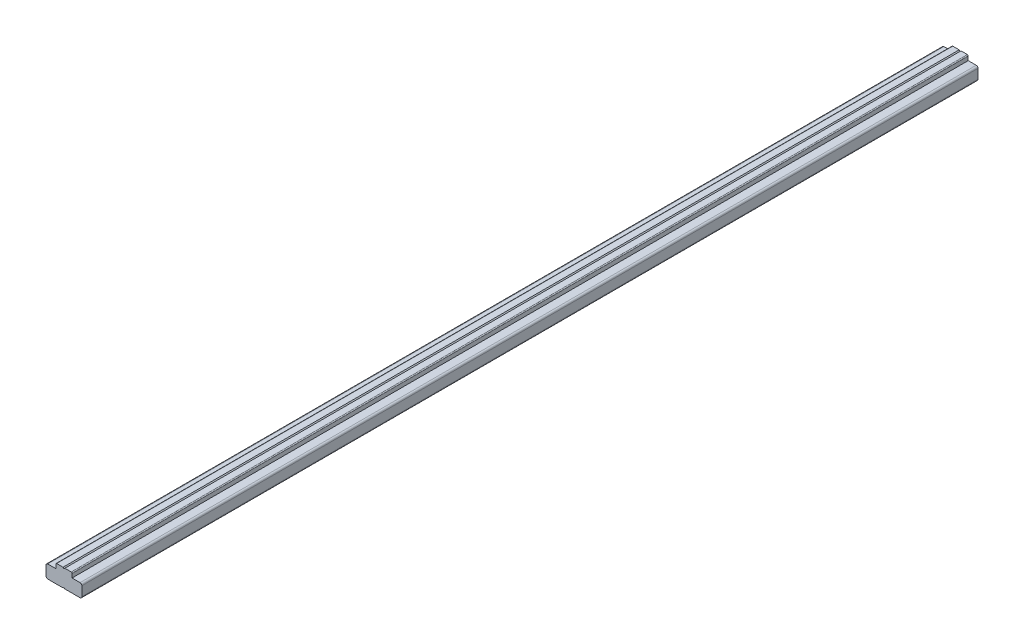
ISO-10303-21;
HEADER;
FILE_DESCRIPTION(('STEP AP214'),'2;1');
FILE_NAME('part.step','',(''),(''),'','','');
FILE_SCHEMA(('AUTOMOTIVE_DESIGN { 1 0 10303 214 1 1 1 1 }'));
ENDSEC;
DATA;
#1=APPLICATION_CONTEXT('core data for automotive mechanical design processes');
#2=APPLICATION_PROTOCOL_DEFINITION('international standard','automotive_design',2000,#1);
#3=PRODUCT_CONTEXT('',#1,'mechanical');
#4=PRODUCT('Part','Part','',(#3));
#5=PRODUCT_RELATED_PRODUCT_CATEGORY('part','',(#4));
#6=PRODUCT_DEFINITION_FORMATION('','',#4);
#7=PRODUCT_DEFINITION_CONTEXT('part definition',#1,'design');
#8=PRODUCT_DEFINITION('design','',#6,#7);
#9=PRODUCT_DEFINITION_SHAPE('','',#8);
#10=(LENGTH_UNIT() NAMED_UNIT(*) SI_UNIT(.MILLI.,.METRE.));
#11=(NAMED_UNIT(*) PLANE_ANGLE_UNIT() SI_UNIT($,.RADIAN.));
#12=(NAMED_UNIT(*) SI_UNIT($,.STERADIAN.) SOLID_ANGLE_UNIT());
#13=UNCERTAINTY_MEASURE_WITH_UNIT(LENGTH_MEASURE(1.E-05),#10,'distance_accuracy_value','');
#14=(GEOMETRIC_REPRESENTATION_CONTEXT(3) GLOBAL_UNCERTAINTY_ASSIGNED_CONTEXT((#13)) GLOBAL_UNIT_ASSIGNED_CONTEXT((#10,
#11,#12)) REPRESENTATION_CONTEXT('',''));
#15=CARTESIAN_POINT('',(0.,0.,0.));
#16=DIRECTION('',(0.,0.,1.));
#17=DIRECTION('',(1.,0.,0.));
#18=AXIS2_PLACEMENT_3D('',#15,#16,#17);
#19=CARTESIAN_POINT('',(0.,0.5,0.));
#20=DIRECTION('',(-0.707106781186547,-0.707106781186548,0.));
#21=DIRECTION('',(0.707106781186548,-0.707106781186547,0.));
#22=AXIS2_PLACEMENT_3D('',#19,#20,#21);
#23=PLANE('',#22);
#24=DIRECTION('',(0.707106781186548,-0.707106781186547,0.));
#25=VECTOR('',#24,1.);
#26=CARTESIAN_POINT('',(0.,0.5,500.));
#27=LINE('',#26,#25);
#28=CARTESIAN_POINT('',(0.,0.5,500.));
#29=VERTEX_POINT('',#28);
#30=CARTESIAN_POINT('',(0.5,0.,500.));
#31=VERTEX_POINT('',#30);
#32=EDGE_CURVE('E212',#29,#31,#27,.T.);
#33=ORIENTED_EDGE('',*,*,#32,.F.);
#34=DIRECTION('',(0.,0.,1.));
#35=VECTOR('',#34,1.);
#36=CARTESIAN_POINT('',(0.,0.5,0.));
#37=LINE('',#36,#35);
#38=CARTESIAN_POINT('',(0.,0.5,0.));
#39=VERTEX_POINT('',#38);
#40=EDGE_CURVE('E177',#39,#29,#37,.T.);
#41=ORIENTED_EDGE('',*,*,#40,.F.);
#42=DIRECTION('',(0.707106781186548,-0.707106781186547,0.));
#43=VECTOR('',#42,1.);
#44=CARTESIAN_POINT('',(0.,0.5,0.));
#45=LINE('',#44,#43);
#46=CARTESIAN_POINT('',(0.5,0.,0.));
#47=VERTEX_POINT('',#46);
#48=EDGE_CURVE('E170',#39,#47,#45,.T.);
#49=ORIENTED_EDGE('',*,*,#48,.T.);
#50=DIRECTION('',(0.,0.,1.));
#51=VECTOR('',#50,1.);
#52=CARTESIAN_POINT('',(0.5,0.,0.));
#53=LINE('',#52,#51);
#54=EDGE_CURVE('E151',#47,#31,#53,.T.);
#55=ORIENTED_EDGE('',*,*,#54,.T.);
#56=EDGE_LOOP('',(#33,#41,#49,#55));
#57=FACE_BOUND('',#56,.T.);
#58=ADVANCED_FACE('F14',(#57),#23,.T.);
#59=CARTESIAN_POINT('',(0.,0.5,0.));
#60=DIRECTION('',(0.707106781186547,-0.707106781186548,0.));
#61=DIRECTION('',(0.707106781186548,0.707106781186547,0.));
#62=AXIS2_PLACEMENT_3D('',#59,#60,#61);
#63=PLANE('',#62);
#64=DIRECTION('',(0.707106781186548,0.707106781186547,0.));
#65=VECTOR('',#64,1.);
#66=CARTESIAN_POINT('',(0.,0.5,500.));
#67=LINE('',#66,#65);
#68=CARTESIAN_POINT('',(-0.5,0.,500.));
#69=VERTEX_POINT('',#68);
#70=EDGE_CURVE('E178',#69,#29,#67,.T.);
#71=ORIENTED_EDGE('',*,*,#70,.F.);
#72=DIRECTION('',(0.,0.,1.));
#73=VECTOR('',#72,1.);
#74=CARTESIAN_POINT('',(-0.5,0.,0.));
#75=LINE('',#74,#73);
#76=CARTESIAN_POINT('',(-0.5,0.,0.));
#77=VERTEX_POINT('',#76);
#78=EDGE_CURVE('E245',#77,#69,#75,.T.);
#79=ORIENTED_EDGE('',*,*,#78,.F.);
#80=DIRECTION('',(0.707106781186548,0.707106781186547,0.));
#81=VECTOR('',#80,1.);
#82=CARTESIAN_POINT('',(0.,0.5,0.));
#83=LINE('',#82,#81);
#84=EDGE_CURVE('E164',#77,#39,#83,.T.);
#85=ORIENTED_EDGE('',*,*,#84,.T.);
#86=ORIENTED_EDGE('',*,*,#40,.T.);
#87=EDGE_LOOP('',(#71,#79,#85,#86));
#88=FACE_BOUND('',#87,.T.);
#89=ADVANCED_FACE('F363',(#88),#63,.T.);
#90=CARTESIAN_POINT('',(-10.,0.,0.));
#91=DIRECTION('',(0.,-1.,0.));
#92=DIRECTION('',(0.,0.,-1.));
#93=AXIS2_PLACEMENT_3D('',#90,#91,#92);
#94=PLANE('',#93);
#95=DIRECTION('',(1.,0.,0.));
#96=VECTOR('',#95,1.);
#97=CARTESIAN_POINT('',(-10.,0.,500.));
#98=LINE('',#97,#96);
#99=CARTESIAN_POINT('',(-9.,0.,500.));
#100=VERTEX_POINT('',#99);
#101=EDGE_CURVE('E181',#100,#69,#98,.T.);
#102=ORIENTED_EDGE('',*,*,#101,.F.);
#103=DIRECTION('',(0.,0.,1.));
#104=VECTOR('',#103,1.);
#105=CARTESIAN_POINT('',(-9.,0.,0.));
#106=LINE('',#105,#104);
#107=CARTESIAN_POINT('',(-9.,0.,0.));
#108=VERTEX_POINT('',#107);
#109=EDGE_CURVE('E291',#100,#108,#106,.F.);
#110=ORIENTED_EDGE('',*,*,#109,.T.);
#111=DIRECTION('',(1.,0.,0.));
#112=VECTOR('',#111,1.);
#113=CARTESIAN_POINT('',(-10.,0.,0.));
#114=LINE('',#113,#112);
#115=EDGE_CURVE('E209',#108,#77,#114,.T.);
#116=ORIENTED_EDGE('',*,*,#115,.T.);
#117=ORIENTED_EDGE('',*,*,#78,.T.);
#118=EDGE_LOOP('',(#102,#110,#116,#117));
#119=FACE_BOUND('',#118,.T.);
#120=ADVANCED_FACE('F369',(#119),#94,.T.);
#121=CARTESIAN_POINT('',(-10.,7.3,0.));
#122=DIRECTION('',(-1.,0.,0.));
#123=DIRECTION('',(0.,-1.,0.));
#124=AXIS2_PLACEMENT_3D('',#121,#122,#123);
#125=PLANE('',#124);
#126=DIRECTION('',(0.,-1.,0.));
#127=VECTOR('',#126,1.);
#128=CARTESIAN_POINT('',(-10.,7.3,500.));
#129=LINE('',#128,#127);
#130=CARTESIAN_POINT('',(-10.,6.3,500.));
#131=VERTEX_POINT('',#130);
#132=CARTESIAN_POINT('',(-10.,1.,500.));
#133=VERTEX_POINT('',#132);
#134=EDGE_CURVE('E239',#131,#133,#129,.T.);
#135=ORIENTED_EDGE('',*,*,#134,.F.);
#136=DIRECTION('',(0.,0.,1.));
#137=VECTOR('',#136,1.);
#138=CARTESIAN_POINT('',(-10.,6.3,0.));
#139=LINE('',#138,#137);
#140=CARTESIAN_POINT('',(-10.,6.3,0.));
#141=VERTEX_POINT('',#140);
#142=EDGE_CURVE('E289',#131,#141,#139,.F.);
#143=ORIENTED_EDGE('',*,*,#142,.T.);
#144=DIRECTION('',(0.,-1.,0.));
#145=VECTOR('',#144,1.);
#146=CARTESIAN_POINT('',(-10.,7.3,0.));
#147=LINE('',#146,#145);
#148=CARTESIAN_POINT('',(-10.,1.,0.));
#149=VERTEX_POINT('',#148);
#150=EDGE_CURVE('E206',#141,#149,#147,.T.);
#151=ORIENTED_EDGE('',*,*,#150,.T.);
#152=DIRECTION('',(0.,0.,1.));
#153=VECTOR('',#152,1.);
#154=CARTESIAN_POINT('',(-10.,1.,0.));
#155=LINE('',#154,#153);
#156=EDGE_CURVE('E286',#149,#133,#155,.T.);
#157=ORIENTED_EDGE('',*,*,#156,.T.);
#158=EDGE_LOOP('',(#135,#143,#151,#157));
#159=FACE_BOUND('',#158,.T.);
#160=ADVANCED_FACE('F395',(#159),#125,.T.);
#161=CARTESIAN_POINT('',(-4.55,7.3,0.));
#162=DIRECTION('',(0.,1.,0.));
#163=DIRECTION('',(-1.,0.,0.));
#164=AXIS2_PLACEMENT_3D('',#161,#162,#163);
#165=PLANE('',#164);
#166=DIRECTION('',(-1.,0.,0.));
#167=VECTOR('',#166,1.);
#168=CARTESIAN_POINT('',(-4.55,7.3,0.));
#169=LINE('',#168,#167);
#170=CARTESIAN_POINT('',(-4.55,7.3,0.));
#171=VERTEX_POINT('',#170);
#172=CARTESIAN_POINT('',(-9.,7.3,0.));
#173=VERTEX_POINT('',#172);
#174=EDGE_CURVE('E203',#171,#173,#169,.T.);
#175=ORIENTED_EDGE('',*,*,#174,.T.);
#176=DIRECTION('',(0.,0.,1.));
#177=VECTOR('',#176,1.);
#178=CARTESIAN_POINT('',(-9.,7.3,0.));
#179=LINE('',#178,#177);
#180=CARTESIAN_POINT('',(-9.,7.3,500.));
#181=VERTEX_POINT('',#180);
#182=EDGE_CURVE('E283',#173,#181,#179,.T.);
#183=ORIENTED_EDGE('',*,*,#182,.T.);
#184=DIRECTION('',(-1.,0.,0.));
#185=VECTOR('',#184,1.);
#186=CARTESIAN_POINT('',(-4.55,7.3,500.));
#187=LINE('',#186,#185);
#188=CARTESIAN_POINT('',(-4.55,7.3,500.));
#189=VERTEX_POINT('',#188);
#190=EDGE_CURVE('E236',#189,#181,#187,.T.);
#191=ORIENTED_EDGE('',*,*,#190,.F.);
#192=DIRECTION('',(0.,0.,1.));
#193=VECTOR('',#192,1.);
#194=CARTESIAN_POINT('',(-4.55,7.3,0.));
#195=LINE('',#194,#193);
#196=EDGE_CURVE('E248',#171,#189,#195,.T.);
#197=ORIENTED_EDGE('',*,*,#196,.F.);
#198=EDGE_LOOP('',(#175,#183,#191,#197));
#199=FACE_BOUND('',#198,.T.);
#200=ADVANCED_FACE('F392',(#199),#165,.T.);
#201=CARTESIAN_POINT('',(-4.55,10.,0.));
#202=DIRECTION('',(-1.,0.,0.));
#203=DIRECTION('',(0.,-1.,0.));
#204=AXIS2_PLACEMENT_3D('',#201,#202,#203);
#205=PLANE('',#204);
#206=DIRECTION('',(0.,-1.,0.));
#207=VECTOR('',#206,1.);
#208=CARTESIAN_POINT('',(-4.55,10.,500.));
#209=LINE('',#208,#207);
#210=CARTESIAN_POINT('',(-4.55,9.5,500.));
#211=VERTEX_POINT('',#210);
#212=EDGE_CURVE('E234',#211,#189,#209,.T.);
#213=ORIENTED_EDGE('',*,*,#212,.F.);
#214=DIRECTION('',(0.,0.,1.));
#215=VECTOR('',#214,1.);
#216=CARTESIAN_POINT('',(-4.55,9.5,0.));
#217=LINE('',#216,#215);
#218=CARTESIAN_POINT('',(-4.55,9.5,0.));
#219=VERTEX_POINT('',#218);
#220=EDGE_CURVE('E9',#211,#219,#217,.F.);
#221=ORIENTED_EDGE('',*,*,#220,.T.);
#222=DIRECTION('',(0.,-1.,0.));
#223=VECTOR('',#222,1.);
#224=CARTESIAN_POINT('',(-4.55,10.,0.));
#225=LINE('',#224,#223);
#226=EDGE_CURVE('E201',#219,#171,#225,.T.);
#227=ORIENTED_EDGE('',*,*,#226,.T.);
#228=ORIENTED_EDGE('',*,*,#196,.T.);
#229=EDGE_LOOP('',(#213,#221,#227,#228));
#230=FACE_BOUND('',#229,.T.);
#231=ADVANCED_FACE('F389',(#230),#205,.T.);
#232=CARTESIAN_POINT('',(-0.5,10.,0.));
#233=DIRECTION('',(0.,1.,0.));
#234=DIRECTION('',(-1.,0.,0.));
#235=AXIS2_PLACEMENT_3D('',#232,#233,#234);
#236=PLANE('',#235);
#237=DIRECTION('',(-1.,0.,0.));
#238=VECTOR('',#237,1.);
#239=CARTESIAN_POINT('',(-0.5,10.,0.));
#240=LINE('',#239,#238);
#241=CARTESIAN_POINT('',(-0.5,10.,0.));
#242=VERTEX_POINT('',#241);
#243=CARTESIAN_POINT('',(-4.05,10.,0.));
#244=VERTEX_POINT('',#243);
#245=EDGE_CURVE('E199',#242,#244,#240,.T.);
#246=ORIENTED_EDGE('',*,*,#245,.T.);
#247=DIRECTION('',(0.,0.,1.));
#248=VECTOR('',#247,1.);
#249=CARTESIAN_POINT('',(-4.05,10.,0.));
#250=LINE('',#249,#248);
#251=CARTESIAN_POINT('',(-4.05,10.,500.));
#252=VERTEX_POINT('',#251);
#253=EDGE_CURVE('E22',#244,#252,#250,.T.);
#254=ORIENTED_EDGE('',*,*,#253,.T.);
#255=DIRECTION('',(-1.,0.,0.));
#256=VECTOR('',#255,1.);
#257=CARTESIAN_POINT('',(-0.5,10.,500.));
#258=LINE('',#257,#256);
#259=CARTESIAN_POINT('',(-0.5,10.,500.));
#260=VERTEX_POINT('',#259);
#261=EDGE_CURVE('E231',#260,#252,#258,.T.);
#262=ORIENTED_EDGE('',*,*,#261,.F.);
#263=DIRECTION('',(0.,0.,1.));
#264=VECTOR('',#263,1.);
#265=CARTESIAN_POINT('',(-0.5,10.,0.));
#266=LINE('',#265,#264);
#267=EDGE_CURVE('E251',#242,#260,#266,.T.);
#268=ORIENTED_EDGE('',*,*,#267,.F.);
#269=EDGE_LOOP('',(#246,#254,#262,#268));
#270=FACE_BOUND('',#269,.T.);
#271=ADVANCED_FACE('F308',(#270),#236,.T.);
#272=CARTESIAN_POINT('',(-0.5,10.,0.));
#273=DIRECTION('',(0.707106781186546,0.707106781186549,0.));
#274=DIRECTION('',(-0.707106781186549,0.707106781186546,0.));
#275=AXIS2_PLACEMENT_3D('',#272,#273,#274);
#276=PLANE('',#275);
#277=DIRECTION('',(-0.707106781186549,0.707106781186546,0.));
#278=VECTOR('',#277,1.);
#279=CARTESIAN_POINT('',(-0.5,10.,500.));
#280=LINE('',#279,#278);
#281=CARTESIAN_POINT('',(0.,9.5,500.));
#282=VERTEX_POINT('',#281);
#283=EDGE_CURVE('E228',#282,#260,#280,.T.);
#284=ORIENTED_EDGE('',*,*,#283,.F.);
#285=DIRECTION('',(0.,0.,1.));
#286=VECTOR('',#285,1.);
#287=CARTESIAN_POINT('',(0.,9.5,0.));
#288=LINE('',#287,#286);
#289=CARTESIAN_POINT('',(0.,9.5,0.));
#290=VERTEX_POINT('',#289);
#291=EDGE_CURVE('E253',#290,#282,#288,.T.);
#292=ORIENTED_EDGE('',*,*,#291,.F.);
#293=DIRECTION('',(-0.707106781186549,0.707106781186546,0.));
#294=VECTOR('',#293,1.);
#295=CARTESIAN_POINT('',(-0.5,10.,0.));
#296=LINE('',#295,#294);
#297=EDGE_CURVE('E196',#290,#242,#296,.T.);
#298=ORIENTED_EDGE('',*,*,#297,.T.);
#299=ORIENTED_EDGE('',*,*,#267,.T.);
#300=EDGE_LOOP('',(#284,#292,#298,#299));
#301=FACE_BOUND('',#300,.T.);
#302=ADVANCED_FACE('F315',(#301),#276,.T.);
#303=CARTESIAN_POINT('',(0.5,10.,0.));
#304=DIRECTION('',(-0.707106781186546,0.707106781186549,0.));
#305=DIRECTION('',(-0.707106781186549,-0.707106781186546,0.));
#306=AXIS2_PLACEMENT_3D('',#303,#304,#305);
#307=PLANE('',#306);
#308=DIRECTION('',(-0.707106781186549,-0.707106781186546,0.));
#309=VECTOR('',#308,1.);
#310=CARTESIAN_POINT('',(0.5,10.,500.));
#311=LINE('',#310,#309);
#312=CARTESIAN_POINT('',(0.5,10.,500.));
#313=VERTEX_POINT('',#312);
#314=EDGE_CURVE('E225',#313,#282,#311,.T.);
#315=ORIENTED_EDGE('',*,*,#314,.F.);
#316=DIRECTION('',(0.,0.,1.));
#317=VECTOR('',#316,1.);
#318=CARTESIAN_POINT('',(0.5,10.,0.));
#319=LINE('',#318,#317);
#320=CARTESIAN_POINT('',(0.5,10.,0.));
#321=VERTEX_POINT('',#320);
#322=EDGE_CURVE('E255',#321,#313,#319,.T.);
#323=ORIENTED_EDGE('',*,*,#322,.F.);
#324=DIRECTION('',(-0.707106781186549,-0.707106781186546,0.));
#325=VECTOR('',#324,1.);
#326=CARTESIAN_POINT('',(0.5,10.,0.));
#327=LINE('',#326,#325);
#328=EDGE_CURVE('E193',#321,#290,#327,.T.);
#329=ORIENTED_EDGE('',*,*,#328,.T.);
#330=ORIENTED_EDGE('',*,*,#291,.T.);
#331=EDGE_LOOP('',(#315,#323,#329,#330));
#332=FACE_BOUND('',#331,.T.);
#333=ADVANCED_FACE('F320',(#332),#307,.T.);
#334=CARTESIAN_POINT('',(4.55,10.,0.));
#335=DIRECTION('',(0.,1.,0.));
#336=DIRECTION('',(-1.,0.,0.));
#337=AXIS2_PLACEMENT_3D('',#334,#335,#336);
#338=PLANE('',#337);
#339=DIRECTION('',(-1.,0.,0.));
#340=VECTOR('',#339,1.);
#341=CARTESIAN_POINT('',(4.55,10.,500.));
#342=LINE('',#341,#340);
#343=CARTESIAN_POINT('',(4.05,10.,500.));
#344=VERTEX_POINT('',#343);
#345=EDGE_CURVE('E223',#344,#313,#342,.T.);
#346=ORIENTED_EDGE('',*,*,#345,.F.);
#347=DIRECTION('',(0.,0.,1.));
#348=VECTOR('',#347,1.);
#349=CARTESIAN_POINT('',(4.05,10.,0.));
#350=LINE('',#349,#348);
#351=CARTESIAN_POINT('',(4.05,10.,0.));
#352=VERTEX_POINT('',#351);
#353=EDGE_CURVE('E300',#344,#352,#350,.F.);
#354=ORIENTED_EDGE('',*,*,#353,.T.);
#355=DIRECTION('',(-1.,0.,0.));
#356=VECTOR('',#355,1.);
#357=CARTESIAN_POINT('',(4.55,10.,0.));
#358=LINE('',#357,#356);
#359=EDGE_CURVE('E191',#352,#321,#358,.T.);
#360=ORIENTED_EDGE('',*,*,#359,.T.);
#361=ORIENTED_EDGE('',*,*,#322,.T.);
#362=EDGE_LOOP('',(#346,#354,#360,#361));
#363=FACE_BOUND('',#362,.T.);
#364=ADVANCED_FACE('F323',(#363),#338,.T.);
#365=CARTESIAN_POINT('',(4.55,7.3,0.));
#366=DIRECTION('',(1.,0.,0.));
#367=DIRECTION('',(0.,1.,0.));
#368=AXIS2_PLACEMENT_3D('',#365,#366,#367);
#369=PLANE('',#368);
#370=DIRECTION('',(0.,1.,0.));
#371=VECTOR('',#370,1.);
#372=CARTESIAN_POINT('',(4.55,7.3,0.));
#373=LINE('',#372,#371);
#374=CARTESIAN_POINT('',(4.55,7.3,0.));
#375=VERTEX_POINT('',#374);
#376=CARTESIAN_POINT('',(4.55,9.5,0.));
#377=VERTEX_POINT('',#376);
#378=EDGE_CURVE('E188',#375,#377,#373,.T.);
#379=ORIENTED_EDGE('',*,*,#378,.T.);
#380=DIRECTION('',(0.,0.,1.));
#381=VECTOR('',#380,1.);
#382=CARTESIAN_POINT('',(4.55,9.5,0.));
#383=LINE('',#382,#381);
#384=CARTESIAN_POINT('',(4.55,9.5,500.));
#385=VERTEX_POINT('',#384);
#386=EDGE_CURVE('E293',#377,#385,#383,.T.);
#387=ORIENTED_EDGE('',*,*,#386,.T.);
#388=DIRECTION('',(0.,1.,0.));
#389=VECTOR('',#388,1.);
#390=CARTESIAN_POINT('',(4.55,7.3,500.));
#391=LINE('',#390,#389);
#392=CARTESIAN_POINT('',(4.55,7.3,500.));
#393=VERTEX_POINT('',#392);
#394=EDGE_CURVE('E220',#393,#385,#391,.T.);
#395=ORIENTED_EDGE('',*,*,#394,.F.);
#396=DIRECTION('',(0.,0.,1.));
#397=VECTOR('',#396,1.);
#398=CARTESIAN_POINT('',(4.55,7.3,0.));
#399=LINE('',#398,#397);
#400=EDGE_CURVE('E163',#375,#393,#399,.T.);
#401=ORIENTED_EDGE('',*,*,#400,.F.);
#402=EDGE_LOOP('',(#379,#387,#395,#401));
#403=FACE_BOUND('',#402,.T.);
#404=ADVANCED_FACE('F332',(#403),#369,.T.);
#405=CARTESIAN_POINT('',(10.,7.3,0.));
#406=DIRECTION('',(0.,1.,0.));
#407=DIRECTION('',(-1.,0.,0.));
#408=AXIS2_PLACEMENT_3D('',#405,#406,#407);
#409=PLANE('',#408);
#410=DIRECTION('',(-1.,0.,0.));
#411=VECTOR('',#410,1.);
#412=CARTESIAN_POINT('',(10.,7.3,500.));
#413=LINE('',#412,#411);
#414=CARTESIAN_POINT('',(9.,7.3,500.));
#415=VERTEX_POINT('',#414);
#416=EDGE_CURVE('E218',#415,#393,#413,.T.);
#417=ORIENTED_EDGE('',*,*,#416,.F.);
#418=DIRECTION('',(0.,0.,1.));
#419=VECTOR('',#418,1.);
#420=CARTESIAN_POINT('',(9.,7.3,0.));
#421=LINE('',#420,#419);
#422=CARTESIAN_POINT('',(9.,7.3,0.));
#423=VERTEX_POINT('',#422);
#424=EDGE_CURVE('E272',#415,#423,#421,.F.);
#425=ORIENTED_EDGE('',*,*,#424,.T.);
#426=DIRECTION('',(-1.,0.,0.));
#427=VECTOR('',#426,1.);
#428=CARTESIAN_POINT('',(10.,7.3,0.));
#429=LINE('',#428,#427);
#430=EDGE_CURVE('E186',#423,#375,#429,.T.);
#431=ORIENTED_EDGE('',*,*,#430,.T.);
#432=ORIENTED_EDGE('',*,*,#400,.T.);
#433=EDGE_LOOP('',(#417,#425,#431,#432));
#434=FACE_BOUND('',#433,.T.);
#435=ADVANCED_FACE('F337',(#434),#409,.T.);
#436=CARTESIAN_POINT('',(10.,0.,0.));
#437=DIRECTION('',(1.,0.,0.));
#438=DIRECTION('',(0.,1.,0.));
#439=AXIS2_PLACEMENT_3D('',#436,#437,#438);
#440=PLANE('',#439);
#441=DIRECTION('',(0.,1.,0.));
#442=VECTOR('',#441,1.);
#443=CARTESIAN_POINT('',(10.,0.,0.));
#444=LINE('',#443,#442);
#445=CARTESIAN_POINT('',(10.,1.,0.));
#446=VERTEX_POINT('',#445);
#447=CARTESIAN_POINT('',(10.,6.3,0.));
#448=VERTEX_POINT('',#447);
#449=EDGE_CURVE('E175',#446,#448,#444,.T.);
#450=ORIENTED_EDGE('',*,*,#449,.T.);
#451=DIRECTION('',(0.,0.,1.));
#452=VECTOR('',#451,1.);
#453=CARTESIAN_POINT('',(10.,6.3,0.));
#454=LINE('',#453,#452);
#455=CARTESIAN_POINT('',(10.,6.3,500.));
#456=VERTEX_POINT('',#455);
#457=EDGE_CURVE('E261',#448,#456,#454,.T.);
#458=ORIENTED_EDGE('',*,*,#457,.T.);
#459=DIRECTION('',(0.,1.,0.));
#460=VECTOR('',#459,1.);
#461=CARTESIAN_POINT('',(10.,0.,500.));
#462=LINE('',#461,#460);
#463=CARTESIAN_POINT('',(10.,1.,500.));
#464=VERTEX_POINT('',#463);
#465=EDGE_CURVE('E215',#464,#456,#462,.T.);
#466=ORIENTED_EDGE('',*,*,#465,.F.);
#467=DIRECTION('',(0.,0.,1.));
#468=VECTOR('',#467,1.);
#469=CARTESIAN_POINT('',(10.,1.,0.));
#470=LINE('',#469,#468);
#471=EDGE_CURVE('E244',#464,#446,#470,.F.);
#472=ORIENTED_EDGE('',*,*,#471,.T.);
#473=EDGE_LOOP('',(#450,#458,#466,#472));
#474=FACE_BOUND('',#473,.T.);
#475=ADVANCED_FACE('F345',(#474),#440,.T.);
#476=CARTESIAN_POINT('',(0.5,0.,0.));
#477=DIRECTION('',(0.,-1.,0.));
#478=DIRECTION('',(0.,0.,-1.));
#479=AXIS2_PLACEMENT_3D('',#476,#477,#478);
#480=PLANE('',#479);
#481=DIRECTION('',(1.,0.,0.));
#482=VECTOR('',#481,1.);
#483=CARTESIAN_POINT('',(0.5,0.,0.));
#484=LINE('',#483,#482);
#485=CARTESIAN_POINT('',(9.,0.,0.));
#486=VERTEX_POINT('',#485);
#487=EDGE_CURVE('E155',#47,#486,#484,.T.);
#488=ORIENTED_EDGE('',*,*,#487,.T.);
#489=DIRECTION('',(0.,0.,1.));
#490=VECTOR('',#489,1.);
#491=CARTESIAN_POINT('',(9.,0.,0.));
#492=LINE('',#491,#490);
#493=CARTESIAN_POINT('',(9.,0.,500.));
#494=VERTEX_POINT('',#493);
#495=EDGE_CURVE('E281',#486,#494,#492,.T.);
#496=ORIENTED_EDGE('',*,*,#495,.T.);
#497=DIRECTION('',(1.,0.,0.));
#498=VECTOR('',#497,1.);
#499=CARTESIAN_POINT('',(0.5,0.,500.));
#500=LINE('',#499,#498);
#501=EDGE_CURVE('E158',#31,#494,#500,.T.);
#502=ORIENTED_EDGE('',*,*,#501,.F.);
#503=ORIENTED_EDGE('',*,*,#54,.F.);
#504=EDGE_LOOP('',(#488,#496,#502,#503));
#505=FACE_BOUND('',#504,.T.);
#506=ADVANCED_FACE('F153',(#505),#480,.T.);
#507=CARTESIAN_POINT('',(0.,0.5,0.));
#508=DIRECTION('',(0.,0.,-1.));
#509=DIRECTION('',(-1.,0.,0.));
#510=AXIS2_PLACEMENT_3D('',#507,#508,#509);
#511=PLANE('',#510);
#512=ORIENTED_EDGE('',*,*,#359,.F.);
#513=CARTESIAN_POINT('',(4.05,9.5,0.));
#514=DIRECTION('',(0.,0.,-1.));
#515=DIRECTION('',(-1.,0.,0.));
#516=AXIS2_PLACEMENT_3D('',#513,#514,#515);
#517=CIRCLE('',#516,0.5);
#518=EDGE_CURVE('E303',#352,#377,#517,.T.);
#519=ORIENTED_EDGE('',*,*,#518,.T.);
#520=ORIENTED_EDGE('',*,*,#378,.F.);
#521=ORIENTED_EDGE('',*,*,#430,.F.);
#522=CARTESIAN_POINT('',(9.,6.3,0.));
#523=DIRECTION('',(0.,0.,-1.));
#524=DIRECTION('',(-1.,0.,0.));
#525=AXIS2_PLACEMENT_3D('',#522,#523,#524);
#526=CIRCLE('',#525,1.);
#527=EDGE_CURVE('E279',#423,#448,#526,.T.);
#528=ORIENTED_EDGE('',*,*,#527,.T.);
#529=ORIENTED_EDGE('',*,*,#449,.F.);
#530=CARTESIAN_POINT('',(9.,1.,0.));
#531=DIRECTION('',(0.,0.,-1.));
#532=DIRECTION('',(-1.,0.,0.));
#533=AXIS2_PLACEMENT_3D('',#530,#531,#532);
#534=CIRCLE('',#533,1.);
#535=EDGE_CURVE('E174',#446,#486,#534,.T.);
#536=ORIENTED_EDGE('',*,*,#535,.T.);
#537=ORIENTED_EDGE('',*,*,#487,.F.);
#538=ORIENTED_EDGE('',*,*,#48,.F.);
#539=ORIENTED_EDGE('',*,*,#84,.F.);
#540=ORIENTED_EDGE('',*,*,#115,.F.);
#541=CARTESIAN_POINT('',(-9.,1.,0.));
#542=DIRECTION('',(0.,0.,-1.));
#543=DIRECTION('',(-1.,0.,0.));
#544=AXIS2_PLACEMENT_3D('',#541,#542,#543);
#545=CIRCLE('',#544,1.);
#546=EDGE_CURVE('E274',#108,#149,#545,.T.);
#547=ORIENTED_EDGE('',*,*,#546,.T.);
#548=ORIENTED_EDGE('',*,*,#150,.F.);
#549=CARTESIAN_POINT('',(-9.,6.3,0.));
#550=DIRECTION('',(0.,0.,-1.));
#551=DIRECTION('',(-1.,0.,0.));
#552=AXIS2_PLACEMENT_3D('',#549,#550,#551);
#553=CIRCLE('',#552,1.);
#554=EDGE_CURVE('E276',#141,#173,#553,.T.);
#555=ORIENTED_EDGE('',*,*,#554,.T.);
#556=ORIENTED_EDGE('',*,*,#174,.F.);
#557=ORIENTED_EDGE('',*,*,#226,.F.);
#558=CARTESIAN_POINT('',(-4.05,9.5,0.));
#559=DIRECTION('',(0.,0.,-1.));
#560=DIRECTION('',(-1.,0.,0.));
#561=AXIS2_PLACEMENT_3D('',#558,#559,#560);
#562=CIRCLE('',#561,0.5);
#563=EDGE_CURVE('E29',#219,#244,#562,.T.);
#564=ORIENTED_EDGE('',*,*,#563,.T.);
#565=ORIENTED_EDGE('',*,*,#245,.F.);
#566=ORIENTED_EDGE('',*,*,#297,.F.);
#567=ORIENTED_EDGE('',*,*,#328,.F.);
#568=EDGE_LOOP('',(#512,#519,#520,#521,#528,#529,#536,#537,#538,#539,#540,#547,#548,#555,#556,
#557,#564,#565,#566,#567));
#569=FACE_BOUND('',#568,.T.);
#570=ADVANCED_FACE('F168',(#569),#511,.T.);
#571=CARTESIAN_POINT('',(0.,0.5,500.));
#572=DIRECTION('',(0.,0.,-1.));
#573=DIRECTION('',(-1.,0.,0.));
#574=AXIS2_PLACEMENT_3D('',#571,#572,#573);
#575=PLANE('',#574);
#576=ORIENTED_EDGE('',*,*,#394,.T.);
#577=CARTESIAN_POINT('',(4.05,9.5,500.));
#578=DIRECTION('',(0.,0.,-1.));
#579=DIRECTION('',(-1.,0.,0.));
#580=AXIS2_PLACEMENT_3D('',#577,#578,#579);
#581=CIRCLE('',#580,0.5);
#582=EDGE_CURVE('E298',#385,#344,#581,.F.);
#583=ORIENTED_EDGE('',*,*,#582,.T.);
#584=ORIENTED_EDGE('',*,*,#345,.T.);
#585=ORIENTED_EDGE('',*,*,#314,.T.);
#586=ORIENTED_EDGE('',*,*,#283,.T.);
#587=ORIENTED_EDGE('',*,*,#261,.T.);
#588=CARTESIAN_POINT('',(-4.05,9.5,500.));
#589=DIRECTION('',(0.,0.,-1.));
#590=DIRECTION('',(-1.,0.,0.));
#591=AXIS2_PLACEMENT_3D('',#588,#589,#590);
#592=CIRCLE('',#591,0.5);
#593=EDGE_CURVE('E296',#252,#211,#592,.F.);
#594=ORIENTED_EDGE('',*,*,#593,.T.);
#595=ORIENTED_EDGE('',*,*,#212,.T.);
#596=ORIENTED_EDGE('',*,*,#190,.T.);
#597=CARTESIAN_POINT('',(-9.,6.3,500.));
#598=DIRECTION('',(0.,0.,-1.));
#599=DIRECTION('',(-1.,0.,0.));
#600=AXIS2_PLACEMENT_3D('',#597,#598,#599);
#601=CIRCLE('',#600,1.);
#602=EDGE_CURVE('E266',#181,#131,#601,.F.);
#603=ORIENTED_EDGE('',*,*,#602,.T.);
#604=ORIENTED_EDGE('',*,*,#134,.T.);
#605=CARTESIAN_POINT('',(-9.,1.,500.));
#606=DIRECTION('',(0.,0.,-1.));
#607=DIRECTION('',(-1.,0.,0.));
#608=AXIS2_PLACEMENT_3D('',#605,#606,#607);
#609=CIRCLE('',#608,1.);
#610=EDGE_CURVE('E264',#133,#100,#609,.F.);
#611=ORIENTED_EDGE('',*,*,#610,.T.);
#612=ORIENTED_EDGE('',*,*,#101,.T.);
#613=ORIENTED_EDGE('',*,*,#70,.T.);
#614=ORIENTED_EDGE('',*,*,#32,.T.);
#615=ORIENTED_EDGE('',*,*,#501,.T.);
#616=CARTESIAN_POINT('',(9.,1.,500.));
#617=DIRECTION('',(0.,0.,-1.));
#618=DIRECTION('',(-1.,0.,0.));
#619=AXIS2_PLACEMENT_3D('',#616,#617,#618);
#620=CIRCLE('',#619,1.);
#621=EDGE_CURVE('E268',#494,#464,#620,.F.);
#622=ORIENTED_EDGE('',*,*,#621,.T.);
#623=ORIENTED_EDGE('',*,*,#465,.T.);
#624=CARTESIAN_POINT('',(9.,6.3,500.));
#625=DIRECTION('',(0.,0.,-1.));
#626=DIRECTION('',(-1.,0.,0.));
#627=AXIS2_PLACEMENT_3D('',#624,#625,#626);
#628=CIRCLE('',#627,1.);
#629=EDGE_CURVE('E270',#456,#415,#628,.F.);
#630=ORIENTED_EDGE('',*,*,#629,.T.);
#631=ORIENTED_EDGE('',*,*,#416,.T.);
#632=EDGE_LOOP('',(#576,#583,#584,#585,#586,#587,#594,#595,#596,#603,#604,#611,#612,#613,#614,
#615,#622,#623,#630,#631));
#633=FACE_BOUND('',#632,.T.);
#634=ADVANCED_FACE('F311',(#633),#575,.F.);
#635=CARTESIAN_POINT('',(9.,6.3,0.));
#636=DIRECTION('',(0.,0.,1.));
#637=DIRECTION('',(1.,0.,0.));
#638=AXIS2_PLACEMENT_3D('',#635,#636,#637);
#639=CYLINDRICAL_SURFACE('',#638,1.);
#640=ORIENTED_EDGE('',*,*,#527,.F.);
#641=ORIENTED_EDGE('',*,*,#424,.F.);
#642=ORIENTED_EDGE('',*,*,#629,.F.);
#643=ORIENTED_EDGE('',*,*,#457,.F.);
#644=EDGE_LOOP('',(#640,#641,#642,#643));
#645=FACE_BOUND('',#644,.T.);
#646=ADVANCED_FACE('F342',(#645),#639,.T.);
#647=CARTESIAN_POINT('',(9.,1.,0.));
#648=DIRECTION('',(0.,0.,1.));
#649=DIRECTION('',(1.,0.,0.));
#650=AXIS2_PLACEMENT_3D('',#647,#648,#649);
#651=CYLINDRICAL_SURFACE('',#650,1.);
#652=ORIENTED_EDGE('',*,*,#535,.F.);
#653=ORIENTED_EDGE('',*,*,#471,.F.);
#654=ORIENTED_EDGE('',*,*,#621,.F.);
#655=ORIENTED_EDGE('',*,*,#495,.F.);
#656=EDGE_LOOP('',(#652,#653,#654,#655));
#657=FACE_BOUND('',#656,.T.);
#658=ADVANCED_FACE('F348',(#657),#651,.T.);
#659=CARTESIAN_POINT('',(-9.,6.3,0.));
#660=DIRECTION('',(0.,0.,1.));
#661=DIRECTION('',(1.,0.,0.));
#662=AXIS2_PLACEMENT_3D('',#659,#660,#661);
#663=CYLINDRICAL_SURFACE('',#662,1.);
#664=ORIENTED_EDGE('',*,*,#554,.F.);
#665=ORIENTED_EDGE('',*,*,#142,.F.);
#666=ORIENTED_EDGE('',*,*,#602,.F.);
#667=ORIENTED_EDGE('',*,*,#182,.F.);
#668=EDGE_LOOP('',(#664,#665,#666,#667));
#669=FACE_BOUND('',#668,.T.);
#670=ADVANCED_FACE('F350',(#669),#663,.T.);
#671=CARTESIAN_POINT('',(-9.,1.,0.));
#672=DIRECTION('',(0.,0.,1.));
#673=DIRECTION('',(1.,0.,0.));
#674=AXIS2_PLACEMENT_3D('',#671,#672,#673);
#675=CYLINDRICAL_SURFACE('',#674,1.);
#676=ORIENTED_EDGE('',*,*,#546,.F.);
#677=ORIENTED_EDGE('',*,*,#109,.F.);
#678=ORIENTED_EDGE('',*,*,#610,.F.);
#679=ORIENTED_EDGE('',*,*,#156,.F.);
#680=EDGE_LOOP('',(#676,#677,#678,#679));
#681=FACE_BOUND('',#680,.T.);
#682=ADVANCED_FACE('F358',(#681),#675,.T.);
#683=CARTESIAN_POINT('',(4.05,9.5,0.));
#684=DIRECTION('',(0.,0.,1.));
#685=DIRECTION('',(1.,0.,0.));
#686=AXIS2_PLACEMENT_3D('',#683,#684,#685);
#687=CYLINDRICAL_SURFACE('',#686,0.5);
#688=ORIENTED_EDGE('',*,*,#518,.F.);
#689=ORIENTED_EDGE('',*,*,#353,.F.);
#690=ORIENTED_EDGE('',*,*,#582,.F.);
#691=ORIENTED_EDGE('',*,*,#386,.F.);
#692=EDGE_LOOP('',(#688,#689,#690,#691));
#693=FACE_BOUND('',#692,.T.);
#694=ADVANCED_FACE('F329',(#693),#687,.T.);
#695=CARTESIAN_POINT('',(-4.05,9.5,0.));
#696=DIRECTION('',(0.,0.,1.));
#697=DIRECTION('',(1.,0.,0.));
#698=AXIS2_PLACEMENT_3D('',#695,#696,#697);
#699=CYLINDRICAL_SURFACE('',#698,0.5);
#700=ORIENTED_EDGE('',*,*,#563,.F.);
#701=ORIENTED_EDGE('',*,*,#220,.F.);
#702=ORIENTED_EDGE('',*,*,#593,.F.);
#703=ORIENTED_EDGE('',*,*,#253,.F.);
#704=EDGE_LOOP('',(#700,#701,#702,#703));
#705=FACE_BOUND('',#704,.T.);
#706=ADVANCED_FACE('F16',(#705),#699,.T.);
#707=CLOSED_SHELL('',(#58,#89,#120,#160,#200,#231,#271,#302,#333,#364,#404,#435,#475,#506,#570,
#634,#646,#658,#670,#682,#694,#706));
#708=MANIFOLD_SOLID_BREP('B1',#707);
#709=ADVANCED_BREP_SHAPE_REPRESENTATION('',(#18,#708),#14);
#710=SHAPE_DEFINITION_REPRESENTATION(#9,#709);
ENDSEC;
END-ISO-10303-21;
